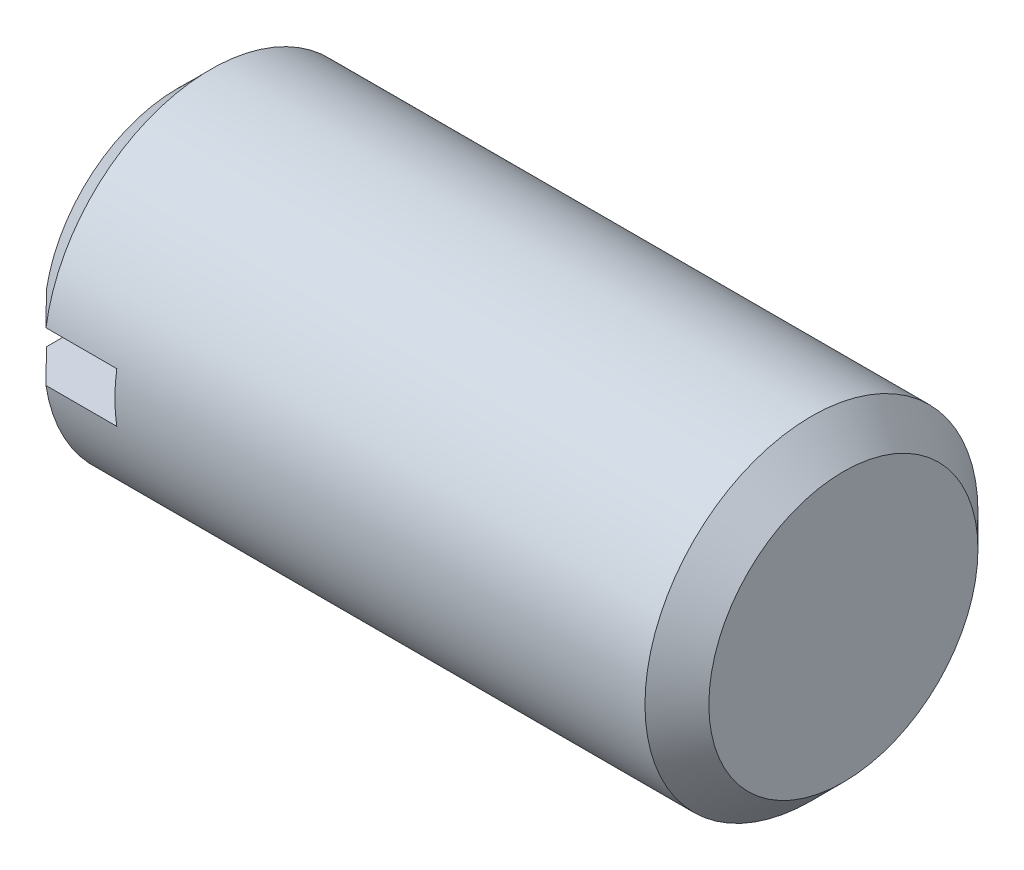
ISO-10303-21;
HEADER;
FILE_DESCRIPTION(('STEP AP214'),'2;1');
FILE_NAME('part.step','',(''),(''),'','','');
FILE_SCHEMA(('AUTOMOTIVE_DESIGN { 1 0 10303 214 1 1 1 1 }'));
ENDSEC;
DATA;
#1=APPLICATION_CONTEXT('core data for automotive mechanical design processes');
#2=APPLICATION_PROTOCOL_DEFINITION('international standard','automotive_design',2000,#1);
#3=PRODUCT_CONTEXT('',#1,'mechanical');
#4=PRODUCT('Part','Part','',(#3));
#5=PRODUCT_RELATED_PRODUCT_CATEGORY('part','',(#4));
#6=PRODUCT_DEFINITION_FORMATION('','',#4);
#7=PRODUCT_DEFINITION_CONTEXT('part definition',#1,'design');
#8=PRODUCT_DEFINITION('design','',#6,#7);
#9=PRODUCT_DEFINITION_SHAPE('','',#8);
#10=(LENGTH_UNIT() NAMED_UNIT(*) SI_UNIT(.MILLI.,.METRE.));
#11=(NAMED_UNIT(*) PLANE_ANGLE_UNIT() SI_UNIT($,.RADIAN.));
#12=(NAMED_UNIT(*) SI_UNIT($,.STERADIAN.) SOLID_ANGLE_UNIT());
#13=UNCERTAINTY_MEASURE_WITH_UNIT(LENGTH_MEASURE(1.E-05),#10,'distance_accuracy_value','');
#14=(GEOMETRIC_REPRESENTATION_CONTEXT(3) GLOBAL_UNCERTAINTY_ASSIGNED_CONTEXT((#13)) GLOBAL_UNIT_ASSIGNED_CONTEXT((#10,
#11,#12)) REPRESENTATION_CONTEXT('',''));
#15=CARTESIAN_POINT('',(0.,0.,0.));
#16=DIRECTION('',(0.,0.,1.));
#17=DIRECTION('',(1.,0.,0.));
#18=AXIS2_PLACEMENT_3D('',#15,#16,#17);
#19=CARTESIAN_POINT('',(2.5,0.6,0.));
#20=DIRECTION('',(1.,0.,0.));
#21=DIRECTION('',(0.,0.,-1.));
#22=AXIS2_PLACEMENT_3D('',#19,#20,#21);
#23=PLANE('',#22);
#24=DIRECTION('',(0.,0.,-1.));
#25=VECTOR('',#24,1.);
#26=CARTESIAN_POINT('',(2.5,-0.6,0.));
#27=LINE('',#26,#25);
#28=CARTESIAN_POINT('',(2.5,-0.6,-3.95474398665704));
#29=VERTEX_POINT('',#28);
#30=CARTESIAN_POINT('',(2.5,-0.6,3.95474398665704));
#31=VERTEX_POINT('',#30);
#32=EDGE_CURVE('E82',#29,#31,#27,.F.);
#33=ORIENTED_EDGE('',*,*,#32,.T.);
#34=CARTESIAN_POINT('',(2.5,0.,0.));
#35=DIRECTION('',(1.,0.,0.));
#36=DIRECTION('',(0.,0.,-1.));
#37=AXIS2_PLACEMENT_3D('',#34,#35,#36);
#38=CIRCLE('',#37,4.);
#39=CARTESIAN_POINT('',(2.5,0.6,3.95474398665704));
#40=VERTEX_POINT('',#39);
#41=EDGE_CURVE('E19',#40,#31,#38,.T.);
#42=ORIENTED_EDGE('',*,*,#41,.F.);
#43=DIRECTION('',(0.,0.,1.));
#44=VECTOR('',#43,1.);
#45=CARTESIAN_POINT('',(2.5,0.6,0.));
#46=LINE('',#45,#44);
#47=CARTESIAN_POINT('',(2.5,0.6,-3.95474398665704));
#48=VERTEX_POINT('',#47);
#49=EDGE_CURVE('E74',#40,#48,#46,.F.);
#50=ORIENTED_EDGE('',*,*,#49,.T.);
#51=CARTESIAN_POINT('',(2.5,0.,0.));
#52=DIRECTION('',(1.,0.,0.));
#53=DIRECTION('',(0.,0.,-1.));
#54=AXIS2_PLACEMENT_3D('',#51,#52,#53);
#55=CIRCLE('',#54,4.);
#56=EDGE_CURVE('E84',#29,#48,#55,.T.);
#57=ORIENTED_EDGE('',*,*,#56,.F.);
#58=EDGE_LOOP('',(#33,#42,#50,#57));
#59=FACE_BOUND('',#58,.T.);
#60=ADVANCED_FACE('F16',(#59),#23,.F.);
#61=CARTESIAN_POINT('',(2.5,-0.6,0.));
#62=DIRECTION('',(0.,-1.,0.));
#63=DIRECTION('',(0.,0.,-1.));
#64=AXIS2_PLACEMENT_3D('',#61,#62,#63);
#65=PLANE('',#64);
#66=DIRECTION('',(1.,0.,0.));
#67=VECTOR('',#66,1.);
#68=CARTESIAN_POINT('',(2.5,-0.6,3.95474398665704));
#69=LINE('',#68,#67);
#70=CARTESIAN_POINT('',(0.80000000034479,-0.6,3.95474398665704));
#71=VERTEX_POINT('',#70);
#72=EDGE_CURVE('E93',#31,#71,#69,.F.);
#73=ORIENTED_EDGE('',*,*,#72,.F.);
#74=ORIENTED_EDGE('',*,*,#32,.F.);
#75=DIRECTION('',(1.,0.,0.));
#76=VECTOR('',#75,1.);
#77=CARTESIAN_POINT('',(2.5,-0.6,-3.95474398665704));
#78=LINE('',#77,#76);
#79=CARTESIAN_POINT('',(0.800000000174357,-0.6,-3.95474398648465));
#80=VERTEX_POINT('',#79);
#81=EDGE_CURVE('E97',#80,#29,#78,.T.);
#82=ORIENTED_EDGE('',*,*,#81,.F.);
#83=CARTESIAN_POINT('',(-2.89918498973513E-10,-0.599999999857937,-3.14324672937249));
#84=CARTESIAN_POINT('',(0.0665448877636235,-0.599999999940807,-3.21099147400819));
#85=CARTESIAN_POINT('',(0.133126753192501,-0.599999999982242,-3.27869986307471));
#86=CARTESIAN_POINT('',(0.266354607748,-0.600000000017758,-3.41405344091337));
#87=CARTESIAN_POINT('',(0.333000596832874,-0.600000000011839,-3.4816986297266));
#88=CARTESIAN_POINT('',(0.533020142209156,-0.599999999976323,-3.68455380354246));
#89=CARTESIAN_POINT('',(0.666475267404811,-0.599999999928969,-3.81968338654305));
#90=CARTESIAN_POINT('',(0.800000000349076,-0.6,-3.95474398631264));
#91=B_SPLINE_CURVE_WITH_KNOTS('',3,(#83,#84,#85,#86,#87,#88,#89,#90),.UNSPECIFIED.,.F.,.F.,(4,2,
2,4),(0.,0.284882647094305,0.5697651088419,1.1395300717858),.UNSPECIFIED.);
#92=CARTESIAN_POINT('',(-3.88258400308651E-10,-0.6,-3.14324672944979));
#93=VERTEX_POINT('',#92);
#94=EDGE_CURVE('E99',#93,#80,#91,.T.);
#95=ORIENTED_EDGE('',*,*,#94,.F.);
#96=DIRECTION('',(0.,0.,1.));
#97=VECTOR('',#96,1.);
#98=CARTESIAN_POINT('',(0.,-0.6,0.));
#99=LINE('',#98,#97);
#100=CARTESIAN_POINT('',(-3.88258384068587E-10,-0.6,3.14324672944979));
#101=VERTEX_POINT('',#100);
#102=EDGE_CURVE('E115',#101,#93,#99,.F.);
#103=ORIENTED_EDGE('',*,*,#102,.F.);
#104=CARTESIAN_POINT('',(0.800000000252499,-0.600000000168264,3.95474398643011));
#105=CARTESIAN_POINT('',(0.666475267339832,-0.60000000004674,3.81968338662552));
#106=CARTESIAN_POINT('',(0.533020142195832,-0.600000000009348,3.68455380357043));
#107=CARTESIAN_POINT('',(0.333000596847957,-0.599999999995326,3.48169862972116));
#108=CARTESIAN_POINT('',(0.266354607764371,-0.599999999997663,3.41405344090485));
#109=CARTESIAN_POINT('',(0.133126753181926,-0.600000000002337,3.27869986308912));
#110=CARTESIAN_POINT('',(0.066544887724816,-0.600000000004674,3.2109914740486));
#111=CARTESIAN_POINT('',(-3.78328845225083E-10,-0.6,3.1432467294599));
#112=B_SPLINE_CURVE_WITH_KNOTS('',3,(#104,#105,#106,#107,#108,#109,#110,#111),.UNSPECIFIED.,.F.,
.F.,(4,2,2,4),(0.,0.569764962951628,0.854647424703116,1.13953007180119),.UNSPECIFIED.);
#113=EDGE_CURVE('E95',#71,#101,#112,.T.);
#114=ORIENTED_EDGE('',*,*,#113,.F.);
#115=EDGE_LOOP('',(#73,#74,#82,#95,#103,#114));
#116=FACE_BOUND('',#115,.T.);
#117=ADVANCED_FACE('F143',(#116),#65,.F.);
#118=CARTESIAN_POINT('',(0.,0.6,0.));
#119=DIRECTION('',(0.,1.,0.));
#120=DIRECTION('',(0.,0.,1.));
#121=AXIS2_PLACEMENT_3D('',#118,#119,#120);
#122=PLANE('',#121);
#123=DIRECTION('',(1.,0.,0.));
#124=VECTOR('',#123,1.);
#125=CARTESIAN_POINT('',(0.,0.6,-3.95474398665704));
#126=LINE('',#125,#124);
#127=CARTESIAN_POINT('',(0.80000000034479,0.6,-3.95474398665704));
#128=VERTEX_POINT('',#127);
#129=EDGE_CURVE('E86',#48,#128,#126,.F.);
#130=ORIENTED_EDGE('',*,*,#129,.F.);
#131=ORIENTED_EDGE('',*,*,#49,.F.);
#132=DIRECTION('',(1.,0.,0.));
#133=VECTOR('',#132,1.);
#134=CARTESIAN_POINT('',(0.,0.6,3.95474398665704));
#135=LINE('',#134,#133);
#136=CARTESIAN_POINT('',(0.800000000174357,0.6,3.95474398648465));
#137=VERTEX_POINT('',#136);
#138=EDGE_CURVE('E66',#137,#40,#135,.T.);
#139=ORIENTED_EDGE('',*,*,#138,.F.);
#140=CARTESIAN_POINT('',(-2.89918250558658E-10,0.599999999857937,3.14324672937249));
#141=CARTESIAN_POINT('',(0.0665448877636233,0.599999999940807,3.21099147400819));
#142=CARTESIAN_POINT('',(0.133126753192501,0.599999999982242,3.27869986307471));
#143=CARTESIAN_POINT('',(0.266354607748,0.600000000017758,3.41405344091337));
#144=CARTESIAN_POINT('',(0.333000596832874,0.600000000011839,3.4816986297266));
#145=CARTESIAN_POINT('',(0.533020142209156,0.599999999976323,3.68455380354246));
#146=CARTESIAN_POINT('',(0.666475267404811,0.599999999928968,3.81968338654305));
#147=CARTESIAN_POINT('',(0.800000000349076,0.6,3.95474398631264));
#148=B_SPLINE_CURVE_WITH_KNOTS('',3,(#140,#141,#142,#143,#144,#145,#146,#147),.UNSPECIFIED.,.F.,
.F.,(4,2,2,4),(0.,0.284882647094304,0.5697651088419,1.1395300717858),.UNSPECIFIED.);
#149=CARTESIAN_POINT('',(-3.88258390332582E-10,0.6,3.14324672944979));
#150=VERTEX_POINT('',#149);
#151=EDGE_CURVE('E75',#150,#137,#148,.T.);
#152=ORIENTED_EDGE('',*,*,#151,.F.);
#153=DIRECTION('',(0.,0.,1.));
#154=VECTOR('',#153,1.);
#155=CARTESIAN_POINT('',(0.,0.6,0.));
#156=LINE('',#155,#154);
#157=CARTESIAN_POINT('',(-3.88258378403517E-10,0.6,-3.14324672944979));
#158=VERTEX_POINT('',#157);
#159=EDGE_CURVE('E108',#158,#150,#156,.T.);
#160=ORIENTED_EDGE('',*,*,#159,.F.);
#161=CARTESIAN_POINT('',(0.800000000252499,0.600000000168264,-3.95474398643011));
#162=CARTESIAN_POINT('',(0.666475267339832,0.60000000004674,-3.81968338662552));
#163=CARTESIAN_POINT('',(0.533020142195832,0.600000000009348,-3.68455380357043));
#164=CARTESIAN_POINT('',(0.333000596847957,0.599999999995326,-3.48169862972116));
#165=CARTESIAN_POINT('',(0.266354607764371,0.599999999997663,-3.41405344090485));
#166=CARTESIAN_POINT('',(0.133126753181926,0.600000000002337,-3.27869986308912));
#167=CARTESIAN_POINT('',(0.066544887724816,0.600000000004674,-3.2109914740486));
#168=CARTESIAN_POINT('',(-3.78328845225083E-10,0.6,-3.1432467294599));
#169=B_SPLINE_CURVE_WITH_KNOTS('',3,(#161,#162,#163,#164,#165,#166,#167,#168),.UNSPECIFIED.,.F.,
.F.,(4,2,2,4),(0.,0.569764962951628,0.854647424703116,1.13953007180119),.UNSPECIFIED.);
#170=EDGE_CURVE('E34',#128,#158,#169,.T.);
#171=ORIENTED_EDGE('',*,*,#170,.F.);
#172=EDGE_LOOP('',(#130,#131,#139,#152,#160,#171));
#173=FACE_BOUND('',#172,.T.);
#174=ADVANCED_FACE('F85',(#173),#122,.F.);
#175=CARTESIAN_POINT('',(16.,2.,0.));
#176=DIRECTION('',(1.,0.,0.));
#177=DIRECTION('',(0.,0.,-1.));
#178=AXIS2_PLACEMENT_3D('',#175,#176,#177);
#179=PLANE('',#178);
#180=CARTESIAN_POINT('',(16.0000000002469,0.,0.));
#181=DIRECTION('',(-1.,0.,0.));
#182=DIRECTION('',(0.,0.,1.));
#183=AXIS2_PLACEMENT_3D('',#180,#181,#182);
#184=CIRCLE('',#183,3.23218750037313);
#185=CARTESIAN_POINT('',(16.0000000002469,0.,3.23218750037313));
#186=VERTEX_POINT('',#185);
#187=EDGE_CURVE('E105',#186,#186,#184,.T.);
#188=ORIENTED_EDGE('',*,*,#187,.F.);
#189=EDGE_LOOP('',(#188));
#190=FACE_BOUND('',#189,.T.);
#191=ADVANCED_FACE('F153',(#190),#179,.T.);
#192=CARTESIAN_POINT('',(0.,2.,0.));
#193=DIRECTION('',(-1.,0.,0.));
#194=DIRECTION('',(0.,0.,1.));
#195=AXIS2_PLACEMENT_3D('',#192,#193,#194);
#196=PLANE('',#195);
#197=CARTESIAN_POINT('',(-3.97903932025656E-10,0.,0.));
#198=DIRECTION('',(1.,0.,0.));
#199=DIRECTION('',(0.,0.,-1.));
#200=AXIS2_PLACEMENT_3D('',#197,#198,#199);
#201=CIRCLE('',#200,3.2000000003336);
#202=EDGE_CURVE('E102',#101,#93,#201,.T.);
#203=ORIENTED_EDGE('',*,*,#202,.F.);
#204=ORIENTED_EDGE('',*,*,#102,.T.);
#205=EDGE_LOOP('',(#203,#204));
#206=FACE_BOUND('',#205,.T.);
#207=ADVANCED_FACE('F181',(#206),#196,.T.);
#208=CARTESIAN_POINT('',(0.,2.,0.));
#209=DIRECTION('',(-1.,0.,0.));
#210=DIRECTION('',(0.,0.,1.));
#211=AXIS2_PLACEMENT_3D('',#208,#209,#210);
#212=PLANE('',#211);
#213=CARTESIAN_POINT('',(-3.97903932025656E-10,0.,0.));
#214=DIRECTION('',(1.,0.,0.));
#215=DIRECTION('',(0.,0.,-1.));
#216=AXIS2_PLACEMENT_3D('',#213,#214,#215);
#217=CIRCLE('',#216,3.2000000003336);
#218=EDGE_CURVE('E100',#158,#150,#217,.T.);
#219=ORIENTED_EDGE('',*,*,#218,.F.);
#220=ORIENTED_EDGE('',*,*,#159,.T.);
#221=EDGE_LOOP('',(#219,#220));
#222=FACE_BOUND('',#221,.T.);
#223=ADVANCED_FACE('F174',(#222),#212,.T.);
#224=CARTESIAN_POINT('',(15.2331874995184,0.,0.));
#225=DIRECTION('',(-1.,0.,0.));
#226=DIRECTION('',(0.,0.,1.));
#227=AXIS2_PLACEMENT_3D('',#224,#225,#226);
#228=CONICAL_SURFACE('',#227,3.99999999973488,0.786049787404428);
#229=ORIENTED_EDGE('',*,*,#187,.T.);
#230=EDGE_LOOP('',(#229));
#231=FACE_BOUND('',#230,.T.);
#232=CARTESIAN_POINT('',(15.2331875,0.,0.));
#233=DIRECTION('',(1.,0.,0.));
#234=DIRECTION('',(0.,0.,-1.));
#235=AXIS2_PLACEMENT_3D('',#232,#233,#234);
#236=CIRCLE('',#235,4.);
#237=CARTESIAN_POINT('',(15.2331875,0.,-4.));
#238=VERTEX_POINT('',#237);
#239=EDGE_CURVE('E92',#238,#238,#236,.F.);
#240=ORIENTED_EDGE('',*,*,#239,.F.);
#241=EDGE_LOOP('',(#240));
#242=FACE_BOUND('',#241,.T.);
#243=ADVANCED_FACE('F132',(#231,#242),#228,.T.);
#244=CARTESIAN_POINT('',(0.800000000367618,0.,0.));
#245=DIRECTION('',(1.,0.,0.));
#246=DIRECTION('',(0.,0.,-1.));
#247=AXIS2_PLACEMENT_3D('',#244,#245,#246);
#248=CONICAL_SURFACE('',#247,3.99999999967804,0.78539816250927);
#249=ORIENTED_EDGE('',*,*,#113,.T.);
#250=ORIENTED_EDGE('',*,*,#202,.T.);
#251=ORIENTED_EDGE('',*,*,#94,.T.);
#252=CARTESIAN_POINT('',(0.800000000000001,0.,0.));
#253=DIRECTION('',(1.,0.,0.));
#254=DIRECTION('',(0.,0.,-1.));
#255=AXIS2_PLACEMENT_3D('',#252,#253,#254);
#256=CIRCLE('',#255,4.);
#257=EDGE_CURVE('E25',#71,#80,#256,.T.);
#258=ORIENTED_EDGE('',*,*,#257,.F.);
#259=EDGE_LOOP('',(#249,#250,#251,#258));
#260=FACE_BOUND('',#259,.T.);
#261=ADVANCED_FACE('F127',(#260),#248,.T.);
#262=CARTESIAN_POINT('',(0.800000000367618,0.,0.));
#263=DIRECTION('',(1.,0.,0.));
#264=DIRECTION('',(0.,0.,-1.));
#265=AXIS2_PLACEMENT_3D('',#262,#263,#264);
#266=CONICAL_SURFACE('',#265,3.99999999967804,0.78539816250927);
#267=ORIENTED_EDGE('',*,*,#170,.T.);
#268=ORIENTED_EDGE('',*,*,#218,.T.);
#269=ORIENTED_EDGE('',*,*,#151,.T.);
#270=CARTESIAN_POINT('',(0.800000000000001,0.,0.));
#271=DIRECTION('',(1.,0.,0.));
#272=DIRECTION('',(0.,0.,-1.));
#273=AXIS2_PLACEMENT_3D('',#270,#271,#272);
#274=CIRCLE('',#273,4.);
#275=EDGE_CURVE('E11',#128,#137,#274,.T.);
#276=ORIENTED_EDGE('',*,*,#275,.F.);
#277=EDGE_LOOP('',(#267,#268,#269,#276));
#278=FACE_BOUND('',#277,.T.);
#279=ADVANCED_FACE('F122',(#278),#266,.T.);
#280=CARTESIAN_POINT('',(8.,0.,0.));
#281=DIRECTION('',(1.,0.,0.));
#282=DIRECTION('',(0.,0.,-1.));
#283=AXIS2_PLACEMENT_3D('',#280,#281,#282);
#284=CYLINDRICAL_SURFACE('',#283,4.);
#285=ORIENTED_EDGE('',*,*,#41,.T.);
#286=ORIENTED_EDGE('',*,*,#72,.T.);
#287=ORIENTED_EDGE('',*,*,#257,.T.);
#288=ORIENTED_EDGE('',*,*,#81,.T.);
#289=ORIENTED_EDGE('',*,*,#56,.T.);
#290=ORIENTED_EDGE('',*,*,#129,.T.);
#291=ORIENTED_EDGE('',*,*,#275,.T.);
#292=ORIENTED_EDGE('',*,*,#138,.T.);
#293=EDGE_LOOP('',(#285,#286,#287,#288,#289,#290,#291,#292));
#294=FACE_BOUND('',#293,.T.);
#295=ORIENTED_EDGE('',*,*,#239,.T.);
#296=EDGE_LOOP('',(#295));
#297=FACE_BOUND('',#296,.T.);
#298=ADVANCED_FACE('F68',(#294,#297),#284,.T.);
#299=CLOSED_SHELL('',(#60,#117,#174,#191,#207,#223,#243,#261,#279,#298));
#300=MANIFOLD_SOLID_BREP('B1',#299);
#301=ADVANCED_BREP_SHAPE_REPRESENTATION('',(#18,#300),#14);
#302=SHAPE_DEFINITION_REPRESENTATION(#9,#301);
ENDSEC;
END-ISO-10303-21;
